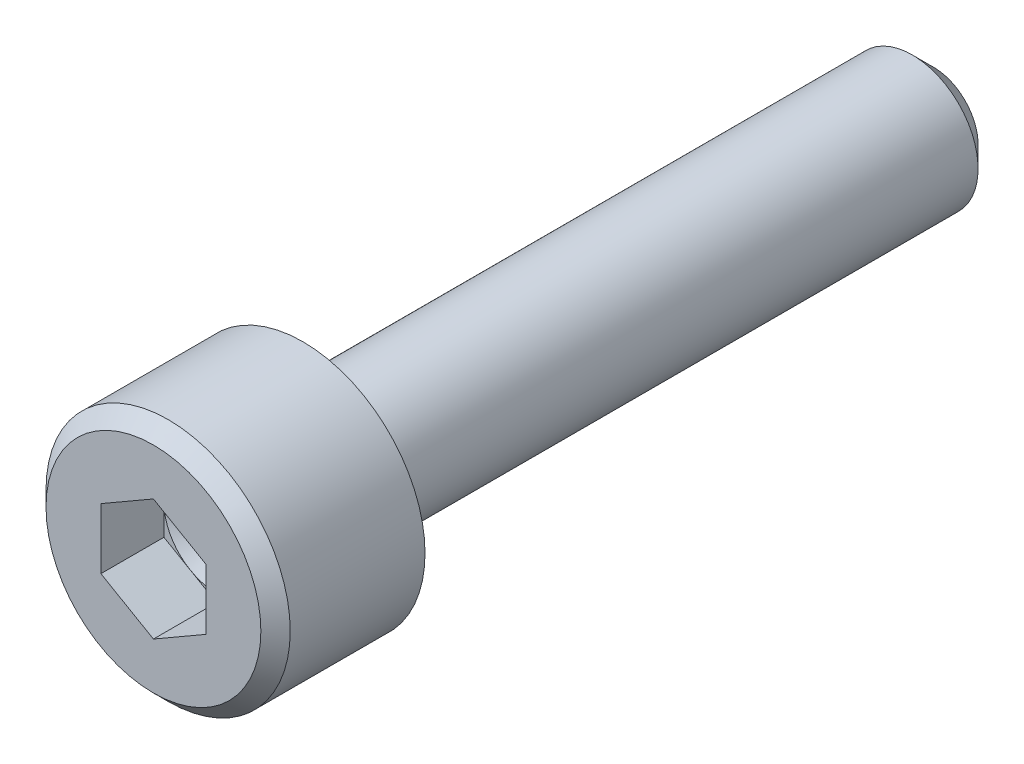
ISO-10303-21;
HEADER;
FILE_DESCRIPTION(('STEP AP214'),'2;1');
FILE_NAME('part.step','',(''),(''),'','','');
FILE_SCHEMA(('AUTOMOTIVE_DESIGN { 1 0 10303 214 1 1 1 1 }'));
ENDSEC;
DATA;
#1=APPLICATION_CONTEXT('core data for automotive mechanical design processes');
#2=APPLICATION_PROTOCOL_DEFINITION('international standard','automotive_design',2000,#1);
#3=PRODUCT_CONTEXT('',#1,'mechanical');
#4=PRODUCT('Part','Part','',(#3));
#5=PRODUCT_RELATED_PRODUCT_CATEGORY('part','',(#4));
#6=PRODUCT_DEFINITION_FORMATION('','',#4);
#7=PRODUCT_DEFINITION_CONTEXT('part definition',#1,'design');
#8=PRODUCT_DEFINITION('design','',#6,#7);
#9=PRODUCT_DEFINITION_SHAPE('','',#8);
#10=(LENGTH_UNIT() NAMED_UNIT(*) SI_UNIT(.MILLI.,.METRE.));
#11=(NAMED_UNIT(*) PLANE_ANGLE_UNIT() SI_UNIT($,.RADIAN.));
#12=(NAMED_UNIT(*) SI_UNIT($,.STERADIAN.) SOLID_ANGLE_UNIT());
#13=UNCERTAINTY_MEASURE_WITH_UNIT(LENGTH_MEASURE(1.E-05),#10,'distance_accuracy_value','');
#14=(GEOMETRIC_REPRESENTATION_CONTEXT(3) GLOBAL_UNCERTAINTY_ASSIGNED_CONTEXT((#13)) GLOBAL_UNIT_ASSIGNED_CONTEXT((#10,
#11,#12)) REPRESENTATION_CONTEXT('',''));
#15=CARTESIAN_POINT('',(0.,0.,0.));
#16=DIRECTION('',(0.,0.,1.));
#17=DIRECTION('',(1.,0.,0.));
#18=AXIS2_PLACEMENT_3D('',#15,#16,#17);
#19=CARTESIAN_POINT('',(-2.,0.,1.6448));
#20=DIRECTION('',(0.,0.,-1.));
#21=DIRECTION('',(-1.,0.,0.));
#22=AXIS2_PLACEMENT_3D('',#19,#20,#21);
#23=PLANE('',#22);
#24=CARTESIAN_POINT('',(0.,0.,1.6448));
#25=DIRECTION('',(0.,0.,1.));
#26=DIRECTION('',(1.,0.,0.));
#27=AXIS2_PLACEMENT_3D('',#24,#25,#26);
#28=CIRCLE('',#27,1.);
#29=CARTESIAN_POINT('',(1.,0.,1.6448));
#30=VERTEX_POINT('',#29);
#31=CARTESIAN_POINT('',(0.5,0.866025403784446,1.6448));
#32=VERTEX_POINT('',#31);
#33=EDGE_CURVE('E25',#30,#32,#28,.T.);
#34=ORIENTED_EDGE('',*,*,#33,.F.);
#35=DIRECTION('',(0.,1.,0.));
#36=VECTOR('',#35,1.);
#37=CARTESIAN_POINT('',(1.,-0.577350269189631,1.6448));
#38=LINE('',#37,#36);
#39=CARTESIAN_POINT('',(1.,0.577350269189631,1.6448));
#40=VERTEX_POINT('',#39);
#41=EDGE_CURVE('E116',#30,#40,#38,.T.);
#42=ORIENTED_EDGE('',*,*,#41,.T.);
#43=DIRECTION('',(-0.866025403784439,0.5,0.));
#44=VECTOR('',#43,1.);
#45=CARTESIAN_POINT('',(1.,0.577350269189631,1.6448));
#46=LINE('',#45,#44);
#47=EDGE_CURVE('E112',#40,#32,#46,.T.);
#48=ORIENTED_EDGE('',*,*,#47,.T.);
#49=EDGE_LOOP('',(#34,#42,#48));
#50=FACE_BOUND('',#49,.T.);
#51=ADVANCED_FACE('F14',(#50),#23,.F.);
#52=CARTESIAN_POINT('',(-0.5,0.866025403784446,1.6448));
#53=VERTEX_POINT('',#52);
#54=EDGE_CURVE('E9',#32,#53,#28,.T.);
#55=ORIENTED_EDGE('',*,*,#54,.F.);
#56=CARTESIAN_POINT('',(0.,1.15470053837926,1.6448));
#57=VERTEX_POINT('',#56);
#58=EDGE_CURVE('E104',#32,#57,#46,.T.);
#59=ORIENTED_EDGE('',*,*,#58,.T.);
#60=DIRECTION('',(-0.866025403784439,-0.5,0.));
#61=VECTOR('',#60,1.);
#62=CARTESIAN_POINT('',(0.,1.15470053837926,1.6448));
#63=LINE('',#62,#61);
#64=EDGE_CURVE('E107',#57,#53,#63,.T.);
#65=ORIENTED_EDGE('',*,*,#64,.T.);
#66=EDGE_LOOP('',(#55,#59,#65));
#67=FACE_BOUND('',#66,.T.);
#68=ADVANCED_FACE('F103',(#67),#23,.F.);
#69=CARTESIAN_POINT('',(-1.,0.,1.6448));
#70=VERTEX_POINT('',#69);
#71=EDGE_CURVE('E23',#53,#70,#28,.T.);
#72=ORIENTED_EDGE('',*,*,#71,.F.);
#73=CARTESIAN_POINT('',(-1.,0.577350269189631,1.6448));
#74=VERTEX_POINT('',#73);
#75=EDGE_CURVE('E118',#53,#74,#63,.T.);
#76=ORIENTED_EDGE('',*,*,#75,.T.);
#77=DIRECTION('',(0.,-1.,0.));
#78=VECTOR('',#77,1.);
#79=CARTESIAN_POINT('',(-1.,0.577350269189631,1.6448));
#80=LINE('',#79,#78);
#81=EDGE_CURVE('E124',#74,#70,#80,.T.);
#82=ORIENTED_EDGE('',*,*,#81,.T.);
#83=EDGE_LOOP('',(#72,#76,#82));
#84=FACE_BOUND('',#83,.T.);
#85=ADVANCED_FACE('F203',(#84),#23,.F.);
#86=CARTESIAN_POINT('',(-0.5,-0.866025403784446,1.6448));
#87=VERTEX_POINT('',#86);
#88=EDGE_CURVE('E156',#70,#87,#28,.T.);
#89=ORIENTED_EDGE('',*,*,#88,.F.);
#90=CARTESIAN_POINT('',(-1.,-0.577350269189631,1.6448));
#91=VERTEX_POINT('',#90);
#92=EDGE_CURVE('E123',#70,#91,#80,.T.);
#93=ORIENTED_EDGE('',*,*,#92,.T.);
#94=DIRECTION('',(0.866025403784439,-0.5,0.));
#95=VECTOR('',#94,1.);
#96=CARTESIAN_POINT('',(-1.,-0.577350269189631,1.6448));
#97=LINE('',#96,#95);
#98=EDGE_CURVE('E174',#91,#87,#97,.T.);
#99=ORIENTED_EDGE('',*,*,#98,.T.);
#100=EDGE_LOOP('',(#89,#93,#99));
#101=FACE_BOUND('',#100,.T.);
#102=ADVANCED_FACE('F211',(#101),#23,.F.);
#103=CARTESIAN_POINT('',(0.5,-0.866025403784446,1.6448));
#104=VERTEX_POINT('',#103);
#105=EDGE_CURVE('E32',#87,#104,#28,.T.);
#106=ORIENTED_EDGE('',*,*,#105,.F.);
#107=CARTESIAN_POINT('',(0.,-1.15470053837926,1.6448));
#108=VERTEX_POINT('',#107);
#109=EDGE_CURVE('E173',#87,#108,#97,.T.);
#110=ORIENTED_EDGE('',*,*,#109,.T.);
#111=DIRECTION('',(0.866025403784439,0.5,0.));
#112=VECTOR('',#111,1.);
#113=CARTESIAN_POINT('',(0.,-1.15470053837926,1.6448));
#114=LINE('',#113,#112);
#115=EDGE_CURVE('E177',#108,#104,#114,.T.);
#116=ORIENTED_EDGE('',*,*,#115,.T.);
#117=EDGE_LOOP('',(#106,#110,#116));
#118=FACE_BOUND('',#117,.T.);
#119=ADVANCED_FACE('F208',(#118),#23,.F.);
#120=EDGE_CURVE('E96',#104,#30,#28,.T.);
#121=ORIENTED_EDGE('',*,*,#120,.F.);
#122=CARTESIAN_POINT('',(1.,-0.577350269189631,1.6448));
#123=VERTEX_POINT('',#122);
#124=EDGE_CURVE('E176',#104,#123,#114,.T.);
#125=ORIENTED_EDGE('',*,*,#124,.T.);
#126=EDGE_CURVE('E114',#123,#30,#38,.T.);
#127=ORIENTED_EDGE('',*,*,#126,.T.);
#128=EDGE_LOOP('',(#121,#125,#127));
#129=FACE_BOUND('',#128,.T.);
#130=ADVANCED_FACE('F185',(#129),#23,.F.);
#131=CARTESIAN_POINT('',(0.,2.3241,0.));
#132=DIRECTION('',(0.,0.,-1.));
#133=DIRECTION('',(-1.,0.,0.));
#134=AXIS2_PLACEMENT_3D('',#131,#132,#133);
#135=PLANE('',#134);
#136=CARTESIAN_POINT('',(0.,0.,0.));
#137=DIRECTION('',(0.,0.,1.));
#138=DIRECTION('',(1.,0.,0.));
#139=AXIS2_PLACEMENT_3D('',#136,#137,#138);
#140=CIRCLE('',#139,2.3241);
#141=CARTESIAN_POINT('',(2.3241,0.,0.));
#142=VERTEX_POINT('',#141);
#143=EDGE_CURVE('E141',#142,#142,#140,.T.);
#144=ORIENTED_EDGE('',*,*,#143,.F.);
#145=EDGE_LOOP('',(#144));
#146=FACE_BOUND('',#145,.T.);
#147=CARTESIAN_POINT('',(0.,0.,0.));
#148=DIRECTION('',(0.,0.,-1.));
#149=DIRECTION('',(-1.,0.,0.));
#150=AXIS2_PLACEMENT_3D('',#147,#148,#149);
#151=CIRCLE('',#150,1.25);
#152=CARTESIAN_POINT('',(-1.25,0.,0.));
#153=VERTEX_POINT('',#152);
#154=EDGE_CURVE('E130',#153,#153,#151,.T.);
#155=ORIENTED_EDGE('',*,*,#154,.F.);
#156=EDGE_LOOP('',(#155));
#157=FACE_BOUND('',#156,.T.);
#158=ADVANCED_FACE('F233',(#146,#157),#135,.T.);
#159=CARTESIAN_POINT('',(0.,0.,2.8448));
#160=DIRECTION('',(0.,0.,1.));
#161=DIRECTION('',(1.,0.,0.));
#162=AXIS2_PLACEMENT_3D('',#159,#160,#161);
#163=PLANE('',#162);
#164=DIRECTION('',(0.866025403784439,-0.5,0.));
#165=VECTOR('',#164,1.);
#166=CARTESIAN_POINT('',(-1.,-0.577350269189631,2.8448));
#167=LINE('',#166,#165);
#168=CARTESIAN_POINT('',(-1.,-0.577350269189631,2.8448));
#169=VERTEX_POINT('',#168);
#170=CARTESIAN_POINT('',(0.,-1.15470053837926,2.8448));
#171=VERTEX_POINT('',#170);
#172=EDGE_CURVE('E40',#169,#171,#167,.T.);
#173=ORIENTED_EDGE('',*,*,#172,.F.);
#174=DIRECTION('',(0.,-1.,0.));
#175=VECTOR('',#174,1.);
#176=CARTESIAN_POINT('',(-1.,0.577350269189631,2.8448));
#177=LINE('',#176,#175);
#178=CARTESIAN_POINT('',(-1.,0.577350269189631,2.8448));
#179=VERTEX_POINT('',#178);
#180=EDGE_CURVE('E170',#179,#169,#177,.T.);
#181=ORIENTED_EDGE('',*,*,#180,.F.);
#182=DIRECTION('',(-0.866025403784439,-0.5,0.));
#183=VECTOR('',#182,1.);
#184=CARTESIAN_POINT('',(0.,1.15470053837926,2.8448));
#185=LINE('',#184,#183);
#186=CARTESIAN_POINT('',(0.,1.15470053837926,2.8448));
#187=VERTEX_POINT('',#186);
#188=EDGE_CURVE('E167',#187,#179,#185,.T.);
#189=ORIENTED_EDGE('',*,*,#188,.F.);
#190=DIRECTION('',(-0.866025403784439,0.5,0.));
#191=VECTOR('',#190,1.);
#192=CARTESIAN_POINT('',(1.,0.577350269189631,2.8448));
#193=LINE('',#192,#191);
#194=CARTESIAN_POINT('',(1.,0.577350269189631,2.8448));
#195=VERTEX_POINT('',#194);
#196=EDGE_CURVE('E165',#195,#187,#193,.T.);
#197=ORIENTED_EDGE('',*,*,#196,.F.);
#198=DIRECTION('',(0.,1.,0.));
#199=VECTOR('',#198,1.);
#200=CARTESIAN_POINT('',(1.,-0.577350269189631,2.8448));
#201=LINE('',#200,#199);
#202=CARTESIAN_POINT('',(1.,-0.577350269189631,2.8448));
#203=VERTEX_POINT('',#202);
#204=EDGE_CURVE('E162',#203,#195,#201,.T.);
#205=ORIENTED_EDGE('',*,*,#204,.F.);
#206=DIRECTION('',(0.866025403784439,0.5,0.));
#207=VECTOR('',#206,1.);
#208=CARTESIAN_POINT('',(0.,-1.15470053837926,2.8448));
#209=LINE('',#208,#207);
#210=EDGE_CURVE('E159',#171,#203,#209,.T.);
#211=ORIENTED_EDGE('',*,*,#210,.F.);
#212=EDGE_LOOP('',(#173,#181,#189,#197,#205,#211));
#213=FACE_BOUND('',#212,.T.);
#214=CARTESIAN_POINT('',(0.,0.,2.8448));
#215=DIRECTION('',(0.,0.,1.));
#216=DIRECTION('',(1.,0.,0.));
#217=AXIS2_PLACEMENT_3D('',#214,#215,#216);
#218=CIRCLE('',#217,2.0447);
#219=CARTESIAN_POINT('',(2.0447,0.,2.8448));
#220=VERTEX_POINT('',#219);
#221=EDGE_CURVE('E147',#220,#220,#218,.T.);
#222=ORIENTED_EDGE('',*,*,#221,.T.);
#223=EDGE_LOOP('',(#222));
#224=FACE_BOUND('',#223,.T.);
#225=ADVANCED_FACE('F16',(#213,#224),#163,.T.);
#226=CARTESIAN_POINT('',(0.,0.,2.8448));
#227=DIRECTION('',(0.,0.,-1.));
#228=DIRECTION('',(-1.,0.,0.));
#229=AXIS2_PLACEMENT_3D('',#226,#227,#228);
#230=CONICAL_SURFACE('',#229,2.0447,0.785398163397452);
#231=CARTESIAN_POINT('',(0.,0.,2.5654));
#232=DIRECTION('',(0.,0.,1.));
#233=DIRECTION('',(1.,0.,0.));
#234=AXIS2_PLACEMENT_3D('',#231,#232,#233);
#235=CIRCLE('',#234,2.3241);
#236=CARTESIAN_POINT('',(2.3241,0.,2.5654));
#237=VERTEX_POINT('',#236);
#238=EDGE_CURVE('E144',#237,#237,#235,.T.);
#239=ORIENTED_EDGE('',*,*,#238,.T.);
#240=EDGE_LOOP('',(#239));
#241=FACE_BOUND('',#240,.T.);
#242=ORIENTED_EDGE('',*,*,#221,.F.);
#243=EDGE_LOOP('',(#242));
#244=FACE_BOUND('',#243,.T.);
#245=ADVANCED_FACE('F292',(#241,#244),#230,.T.);
#246=CARTESIAN_POINT('',(0.,0.,34.5948));
#247=DIRECTION('',(0.,0.,1.));
#248=DIRECTION('',(1.,0.,0.));
#249=AXIS2_PLACEMENT_3D('',#246,#247,#248);
#250=CYLINDRICAL_SURFACE('',#249,2.3241);
#251=ORIENTED_EDGE('',*,*,#143,.T.);
#252=EDGE_LOOP('',(#251));
#253=FACE_BOUND('',#252,.T.);
#254=ORIENTED_EDGE('',*,*,#238,.F.);
#255=EDGE_LOOP('',(#254));
#256=FACE_BOUND('',#255,.T.);
#257=ADVANCED_FACE('F298',(#253,#256),#250,.T.);
#258=CARTESIAN_POINT('',(0.,0.,-12.));
#259=DIRECTION('',(0.,0.,1.));
#260=DIRECTION('',(1.,0.,0.));
#261=AXIS2_PLACEMENT_3D('',#258,#259,#260);
#262=CYLINDRICAL_SURFACE('',#261,1.25);
#263=CARTESIAN_POINT('',(0.,0.,-11.6));
#264=DIRECTION('',(0.,0.,-1.));
#265=DIRECTION('',(-1.,0.,0.));
#266=AXIS2_PLACEMENT_3D('',#263,#264,#265);
#267=CIRCLE('',#266,1.25);
#268=CARTESIAN_POINT('',(-1.25,0.,-11.6));
#269=VERTEX_POINT('',#268);
#270=EDGE_CURVE('E18',#269,#269,#267,.F.);
#271=ORIENTED_EDGE('',*,*,#270,.T.);
#272=EDGE_LOOP('',(#271));
#273=FACE_BOUND('',#272,.T.);
#274=ORIENTED_EDGE('',*,*,#154,.T.);
#275=EDGE_LOOP('',(#274));
#276=FACE_BOUND('',#275,.T.);
#277=ADVANCED_FACE('F306',(#273,#276),#262,.T.);
#278=CARTESIAN_POINT('',(0.,0.,-12.));
#279=DIRECTION('',(0.,0.,-1.));
#280=DIRECTION('',(-1.,0.,0.));
#281=AXIS2_PLACEMENT_3D('',#278,#279,#280);
#282=PLANE('',#281);
#283=CARTESIAN_POINT('',(0.,0.,-12.));
#284=DIRECTION('',(0.,0.,-1.));
#285=DIRECTION('',(-1.,0.,0.));
#286=AXIS2_PLACEMENT_3D('',#283,#284,#285);
#287=CIRCLE('',#286,0.85);
#288=CARTESIAN_POINT('',(-0.85,0.,-12.));
#289=VERTEX_POINT('',#288);
#290=EDGE_CURVE('E149',#289,#289,#287,.T.);
#291=ORIENTED_EDGE('',*,*,#290,.T.);
#292=EDGE_LOOP('',(#291));
#293=FACE_BOUND('',#292,.T.);
#294=ADVANCED_FACE('F315',(#293),#282,.T.);
#295=CARTESIAN_POINT('',(0.,0.,-12.));
#296=DIRECTION('',(0.,0.,1.));
#297=DIRECTION('',(1.,0.,0.));
#298=AXIS2_PLACEMENT_3D('',#295,#296,#297);
#299=CONICAL_SURFACE('',#298,0.85,0.785398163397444);
#300=ORIENTED_EDGE('',*,*,#270,.F.);
#301=EDGE_LOOP('',(#300));
#302=FACE_BOUND('',#301,.T.);
#303=ORIENTED_EDGE('',*,*,#290,.F.);
#304=EDGE_LOOP('',(#303));
#305=FACE_BOUND('',#304,.T.);
#306=ADVANCED_FACE('F224',(#302,#305),#299,.T.);
#307=CARTESIAN_POINT('',(-1.,-0.577350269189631,1.6448));
#308=DIRECTION('',(-0.5,-0.866025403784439,0.));
#309=DIRECTION('',(-0.866025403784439,0.5,0.));
#310=AXIS2_PLACEMENT_3D('',#307,#308,#309);
#311=PLANE('',#310);
#312=ORIENTED_EDGE('',*,*,#172,.T.);
#313=DIRECTION('',(0.,0.,1.));
#314=VECTOR('',#313,1.);
#315=CARTESIAN_POINT('',(0.,-1.15470053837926,1.6448));
#316=LINE('',#315,#314);
#317=EDGE_CURVE('E127',#108,#171,#316,.T.);
#318=ORIENTED_EDGE('',*,*,#317,.F.);
#319=ORIENTED_EDGE('',*,*,#109,.F.);
#320=ORIENTED_EDGE('',*,*,#98,.F.);
#321=DIRECTION('',(0.,0.,1.));
#322=VECTOR('',#321,1.);
#323=CARTESIAN_POINT('',(-1.,-0.577350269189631,1.6448));
#324=LINE('',#323,#322);
#325=EDGE_CURVE('E128',#91,#169,#324,.T.);
#326=ORIENTED_EDGE('',*,*,#325,.T.);
#327=EDGE_LOOP('',(#312,#318,#319,#320,#326));
#328=FACE_BOUND('',#327,.T.);
#329=ADVANCED_FACE('F210',(#328),#311,.F.);
#330=CARTESIAN_POINT('',(-1.,0.577350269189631,1.6448));
#331=DIRECTION('',(-1.,0.,0.));
#332=DIRECTION('',(0.,0.,1.));
#333=AXIS2_PLACEMENT_3D('',#330,#331,#332);
#334=PLANE('',#333);
#335=ORIENTED_EDGE('',*,*,#180,.T.);
#336=ORIENTED_EDGE('',*,*,#325,.F.);
#337=ORIENTED_EDGE('',*,*,#92,.F.);
#338=ORIENTED_EDGE('',*,*,#81,.F.);
#339=DIRECTION('',(0.,0.,1.));
#340=VECTOR('',#339,1.);
#341=CARTESIAN_POINT('',(-1.,0.577350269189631,1.6448));
#342=LINE('',#341,#340);
#343=EDGE_CURVE('E131',#74,#179,#342,.T.);
#344=ORIENTED_EDGE('',*,*,#343,.T.);
#345=EDGE_LOOP('',(#335,#336,#337,#338,#344));
#346=FACE_BOUND('',#345,.T.);
#347=ADVANCED_FACE('F214',(#346),#334,.F.);
#348=CARTESIAN_POINT('',(0.,1.15470053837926,1.6448));
#349=DIRECTION('',(-0.5,0.866025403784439,0.));
#350=DIRECTION('',(0.866025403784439,0.5,0.));
#351=AXIS2_PLACEMENT_3D('',#348,#349,#350);
#352=PLANE('',#351);
#353=ORIENTED_EDGE('',*,*,#188,.T.);
#354=ORIENTED_EDGE('',*,*,#343,.F.);
#355=ORIENTED_EDGE('',*,*,#75,.F.);
#356=ORIENTED_EDGE('',*,*,#64,.F.);
#357=DIRECTION('',(0.,0.,1.));
#358=VECTOR('',#357,1.);
#359=CARTESIAN_POINT('',(0.,1.15470053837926,1.6448));
#360=LINE('',#359,#358);
#361=EDGE_CURVE('E113',#57,#187,#360,.T.);
#362=ORIENTED_EDGE('',*,*,#361,.T.);
#363=EDGE_LOOP('',(#353,#354,#355,#356,#362));
#364=FACE_BOUND('',#363,.T.);
#365=ADVANCED_FACE('F199',(#364),#352,.F.);
#366=CARTESIAN_POINT('',(1.,0.577350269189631,1.6448));
#367=DIRECTION('',(0.5,0.866025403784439,0.));
#368=DIRECTION('',(0.866025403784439,-0.5,0.));
#369=AXIS2_PLACEMENT_3D('',#366,#367,#368);
#370=PLANE('',#369);
#371=ORIENTED_EDGE('',*,*,#196,.T.);
#372=ORIENTED_EDGE('',*,*,#361,.F.);
#373=ORIENTED_EDGE('',*,*,#58,.F.);
#374=ORIENTED_EDGE('',*,*,#47,.F.);
#375=DIRECTION('',(0.,0.,1.));
#376=VECTOR('',#375,1.);
#377=CARTESIAN_POINT('',(1.,0.577350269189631,1.6448));
#378=LINE('',#377,#376);
#379=EDGE_CURVE('E134',#40,#195,#378,.T.);
#380=ORIENTED_EDGE('',*,*,#379,.T.);
#381=EDGE_LOOP('',(#371,#372,#373,#374,#380));
#382=FACE_BOUND('',#381,.T.);
#383=ADVANCED_FACE('F111',(#382),#370,.F.);
#384=CARTESIAN_POINT('',(1.,-0.577350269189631,1.6448));
#385=DIRECTION('',(1.,0.,0.));
#386=DIRECTION('',(0.,0.,-1.));
#387=AXIS2_PLACEMENT_3D('',#384,#385,#386);
#388=PLANE('',#387);
#389=ORIENTED_EDGE('',*,*,#204,.T.);
#390=ORIENTED_EDGE('',*,*,#379,.F.);
#391=ORIENTED_EDGE('',*,*,#41,.F.);
#392=ORIENTED_EDGE('',*,*,#126,.F.);
#393=DIRECTION('',(0.,0.,1.));
#394=VECTOR('',#393,1.);
#395=CARTESIAN_POINT('',(1.,-0.577350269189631,1.6448));
#396=LINE('',#395,#394);
#397=EDGE_CURVE('E136',#123,#203,#396,.T.);
#398=ORIENTED_EDGE('',*,*,#397,.T.);
#399=EDGE_LOOP('',(#389,#390,#391,#392,#398));
#400=FACE_BOUND('',#399,.T.);
#401=ADVANCED_FACE('F191',(#400),#388,.F.);
#402=CARTESIAN_POINT('',(0.,-1.15470053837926,1.6448));
#403=DIRECTION('',(0.5,-0.866025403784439,0.));
#404=DIRECTION('',(-0.866025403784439,-0.5,0.));
#405=AXIS2_PLACEMENT_3D('',#402,#403,#404);
#406=PLANE('',#405);
#407=ORIENTED_EDGE('',*,*,#210,.T.);
#408=ORIENTED_EDGE('',*,*,#397,.F.);
#409=ORIENTED_EDGE('',*,*,#124,.F.);
#410=ORIENTED_EDGE('',*,*,#115,.F.);
#411=ORIENTED_EDGE('',*,*,#317,.T.);
#412=EDGE_LOOP('',(#407,#408,#409,#410,#411));
#413=FACE_BOUND('',#412,.T.);
#414=ADVANCED_FACE('F91',(#413),#406,.F.);
#415=CARTESIAN_POINT('',(0.,0.,1.6448));
#416=DIRECTION('',(0.,0.,1.));
#417=DIRECTION('',(1.,0.,0.));
#418=AXIS2_PLACEMENT_3D('',#415,#416,#417);
#419=CONICAL_SURFACE('',#418,1.,1.0471975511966);
#420=CARTESIAN_POINT('',(0.,0.,1.06744973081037));
#421=VERTEX_POINT('',#420);
#422=VERTEX_LOOP('',#421);
#423=FACE_BOUND('',#422,.T.);
#424=ORIENTED_EDGE('',*,*,#33,.T.);
#425=ORIENTED_EDGE('',*,*,#54,.T.);
#426=ORIENTED_EDGE('',*,*,#71,.T.);
#427=ORIENTED_EDGE('',*,*,#88,.T.);
#428=ORIENTED_EDGE('',*,*,#105,.T.);
#429=ORIENTED_EDGE('',*,*,#120,.T.);
#430=EDGE_LOOP('',(#424,#425,#426,#427,#428,#429));
#431=FACE_BOUND('',#430,.T.);
#432=ADVANCED_FACE('F89',(#423,#431),#419,.F.);
#433=CLOSED_SHELL('',(#51,#68,#85,#102,#119,#130,#158,#225,#245,#257,#277,#294,#306,#329,#347,
#365,#383,#401,#414,#432));
#434=MANIFOLD_SOLID_BREP('B1',#433);
#435=ADVANCED_BREP_SHAPE_REPRESENTATION('',(#18,#434),#14);
#436=SHAPE_DEFINITION_REPRESENTATION(#9,#435);
ENDSEC;
END-ISO-10303-21;
